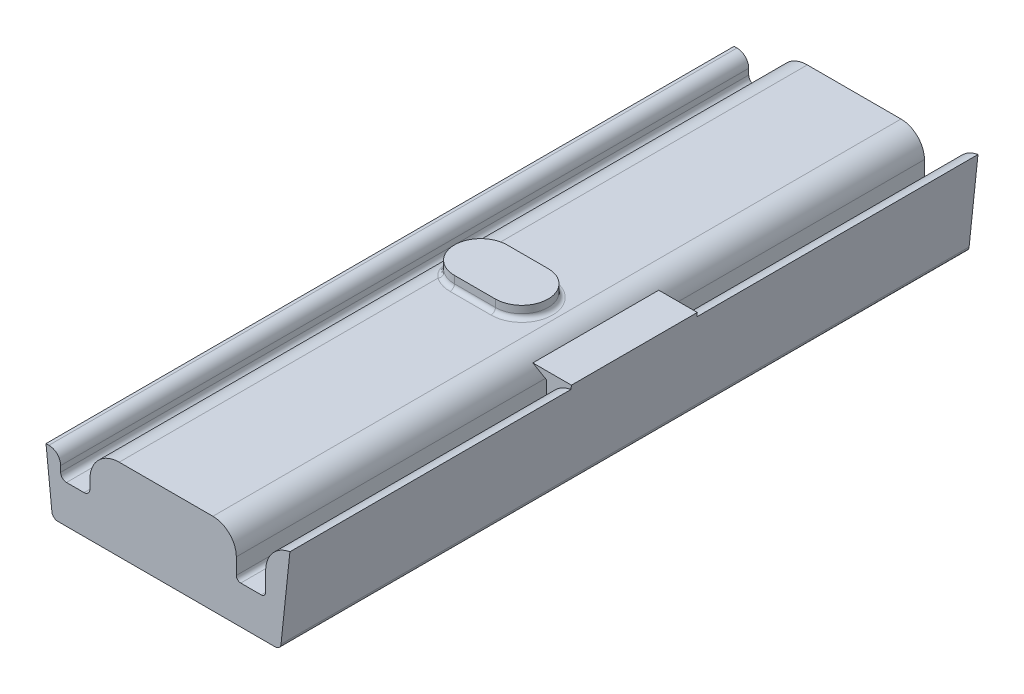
from build123d import *

# Parameters (mm, degrees)
EXTRUSION1_DEPTH        = 117.5
EXTRUSION1_DEPTH_BACK   = 117.5
CONG_1_R                = 2
ENL_V_MAT_EXTRU_1_DEPTH = 241.622877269
EXTRUSION2_DEPTH        = 4
EXTRUSION3_DEPTH        = 21.5
EXTRUSION3_DEPTH_BACK   = 21.5
EXTRUSION4_REACH        = 129.815
EXTRUSION5_DEPTH        = 21.5
EXTRUSION5_DEPTH_BACK   = 21.5
CONG_2_R                = 2
CONG_3_R                = 1.5


with BuildPart() as part:
    # Esquisse1 → Extrusion1 (new, two sides: drawn at the far end of the back side and taken through both)
    with BuildSketch(Plane.XY.offset(-EXTRUSION1_DEPTH_BACK)):
        with BuildLine():
            Line((-41.64953891, 0), (41.64953891, 0))
            Line((41.64953891, 0), (41.64953891, 30.654281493))
            ThreePointArc((41.64953891, 30.654281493), (35.701630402, 27.241691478), (33.35046109, 20.8))
            Line((33.35046109, 20.8), (33.35046109, 14.5))
            ThreePointArc((33.35046109, 14.5), (32.911121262, 13.439339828), (31.85046109, 13))
            Line((31.85046109, 13), (24.85046109, 13))
            ThreePointArc((24.85046109, 13), (23.789800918, 13.439339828), (23.35046109, 14.5))
            Line((23.35046109, 14.5), (23.35046109, 20))
            ThreePointArc((23.35046109, 20), (21.007315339, 25.656854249), (15.35046109, 28))
            Line((15.35046109, 28), (-16.64953891, 28))
            ThreePointArc((-16.64953891, 28), (-23.720606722, 25.071067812), (-26.64953891, 18))
            Line((-26.64953891, 18), (-26.64953891, 15))
            ThreePointArc((-26.64953891, 15), (-27.235325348, 13.585786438), (-28.64953891, 13))
            Line((-28.64953891, 13), (-34.64953891, 13))
            ThreePointArc((-34.64953891, 13), (-36.063752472, 13.585786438), (-36.64953891, 15))
            Line((-36.64953891, 15), (-36.64953891, 17))
            ThreePointArc((-36.64953891, 17), (-37.821111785, 19.828427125), (-40.64953891, 21))
            Line((-40.64953891, 21), (-41.64953891, 21))
            Line((-41.64953891, 21), (-41.64953891, 0))
        make_face()
    extrude(amount=EXTRUSION1_DEPTH + EXTRUSION1_DEPTH_BACK)

    # Cong_1
    cong_1_edges = [part.edges().sort_by_distance(p)[0] for p in [
        (41.64953891, 0, 0),
        (-41.64953891, 0, 0),
    ]]
    fillet(cong_1_edges, radius=CONG_1_R)

    # Esquisse2 → Enl_v. mat.-Extru.1 (cut, through all)
    with BuildSketch(Plane.XY.offset(117.5)):
        Polygon((-39.442349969, 0), (-41.64953891, 21), (-41.64953891, 0), align=None)
        Polygon((38.427644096, 0), (41.64953891, 0), (41.64953891, 30.654281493), align=None)
    extrude(amount=-ENL_V_MAT_EXTRU_1_DEPTH, mode=Mode.SUBTRACT)

    # Esquisse3 → Extrusion2 (add)
    with BuildSketch(Plane(origin=(0, 28, 0), x_dir=(-1, 0, 0), z_dir=(0, 1, 0))):
        with BuildLine():
            Line((-3.338471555, -9), (10.661528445, -9))
            ThreePointArc((10.661528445, -9), (19.661528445, 0), (10.661528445, 9))
            Line((10.661528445, 9), (-3.338471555, 9))
            ThreePointArc((-3.338471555, 9), (-12.338471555, 0), (-3.338471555, -9))
        make_face()
    extrude(amount=EXTRUSION2_DEPTH)

    # Esquisse4 → Extrusion3 (add, two sides: drawn at the far end of the back side and taken through both)
    with BuildSketch(Plane.XY.offset(-EXTRUSION3_DEPTH_BACK)):
        with BuildLine():
            Line((33.35046109, 32), (41.790979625, 32))
            Line((41.790979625, 32), (41.64953891, 30.654281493))
            ThreePointArc((41.64953891, 30.654281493), (35.701630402, 27.241691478), (33.35046109, 20.8))
            Line((33.35046109, 20.8), (33.35046109, 32))
        make_face()
    extrude(amount=EXTRUSION3_DEPTH + EXTRUSION3_DEPTH_BACK)

    # Esquisse5 → Extrusion4 (add, up to next)
    with BuildSketch(Plane.XZ.offset(-28), mode=Mode.PRIVATE) as extrusion4_sk1:
        with BuildLine():
            Line((-16.64953891, -6.718908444), (-16.64953891, 6.718908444))
            ThreePointArc((-16.64953891, 6.718908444), (-19.661528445, 0), (-16.64953891, -6.718908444))
        make_face()
    extrusion4_tool1 = extrude(extrusion4_sk1.sketch, amount=EXTRUSION4_REACH, mode=Mode.PRIVATE) - part.part
    add(extrusion4_tool1.solids().sort_by_distance((-17.873481, 28, 0))[0])

    # Esquisse6 → Extrusion5 (add, two sides: drawn at the far end of the back side and taken through both)
    with BuildSketch(Plane.XY.offset(-EXTRUSION5_DEPTH_BACK)):
        Polygon((33.35046109, 32), (28.620793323, 32), (33.35046109, 29.291037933), align=None)
    extrude(amount=EXTRUSION5_DEPTH + EXTRUSION5_DEPTH_BACK)

    # Cong_2
    cong_2_edges = [part.edges().sort_by_distance(p)[0] for p in [
        (-39.442349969, 0, 0),
        (38.427644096, 0, 0),
    ]]
    fillet(cong_2_edges, radius=CONG_2_R)

    # Cong_3
    cong_3_edges = [part.edges().sort_by_distance(p)[0] for p in [
        (-13.865418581, 28, -8.410415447),
        (-13.865418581, 28, 8.410415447),
        (-3.661528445, 28, 9),
        (12.338471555, 28, 0),
        (-3.661528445, 28, -9),
        (-19.661528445, 27.535613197, 0),
    ]]
    fillet(cong_3_edges, radius=CONG_3_R)


solid = part.part
